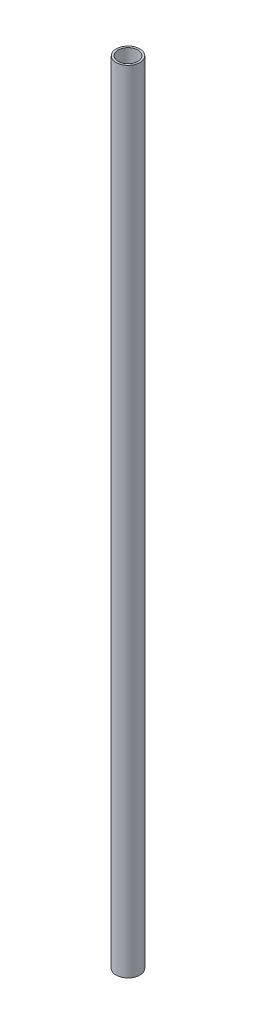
ISO-10303-21;
HEADER;
FILE_DESCRIPTION(('STEP AP214'),'2;1');
FILE_NAME('part.step','',(''),(''),'','','');
FILE_SCHEMA(('AUTOMOTIVE_DESIGN { 1 0 10303 214 1 1 1 1 }'));
ENDSEC;
DATA;
#1=APPLICATION_CONTEXT('core data for automotive mechanical design processes');
#2=APPLICATION_PROTOCOL_DEFINITION('international standard','automotive_design',2000,#1);
#3=PRODUCT_CONTEXT('',#1,'mechanical');
#4=PRODUCT('Part','Part','',(#3));
#5=PRODUCT_RELATED_PRODUCT_CATEGORY('part','',(#4));
#6=PRODUCT_DEFINITION_FORMATION('','',#4);
#7=PRODUCT_DEFINITION_CONTEXT('part definition',#1,'design');
#8=PRODUCT_DEFINITION('design','',#6,#7);
#9=PRODUCT_DEFINITION_SHAPE('','',#8);
#10=(LENGTH_UNIT() NAMED_UNIT(*) SI_UNIT(.MILLI.,.METRE.));
#11=(NAMED_UNIT(*) PLANE_ANGLE_UNIT() SI_UNIT($,.RADIAN.));
#12=(NAMED_UNIT(*) SI_UNIT($,.STERADIAN.) SOLID_ANGLE_UNIT());
#13=UNCERTAINTY_MEASURE_WITH_UNIT(LENGTH_MEASURE(1.E-05),#10,'distance_accuracy_value','');
#14=(GEOMETRIC_REPRESENTATION_CONTEXT(3) GLOBAL_UNCERTAINTY_ASSIGNED_CONTEXT((#13)) GLOBAL_UNIT_ASSIGNED_CONTEXT((#10,
#11,#12)) REPRESENTATION_CONTEXT('',''));
#15=CARTESIAN_POINT('',(0.,0.,0.));
#16=DIRECTION('',(0.,0.,1.));
#17=DIRECTION('',(1.,0.,0.));
#18=AXIS2_PLACEMENT_3D('',#15,#16,#17);
#19=CARTESIAN_POINT('',(0.,400.,0.));
#20=DIRECTION('',(0.,1.,0.));
#21=DIRECTION('',(0.,0.,1.));
#22=AXIS2_PLACEMENT_3D('',#19,#20,#21);
#23=PLANE('',#22);
#24=CARTESIAN_POINT('',(0.,400.,0.));
#25=DIRECTION('',(0.,1.,0.));
#26=DIRECTION('',(0.,0.,1.));
#27=AXIS2_PLACEMENT_3D('',#24,#25,#26);
#28=CIRCLE('',#27,6.);
#29=CARTESIAN_POINT('',(0.,400.,6.));
#30=VERTEX_POINT('',#29);
#31=EDGE_CURVE('E10',#30,#30,#28,.T.);
#32=ORIENTED_EDGE('',*,*,#31,.T.);
#33=EDGE_LOOP('',(#32));
#34=FACE_BOUND('',#33,.T.);
#35=CARTESIAN_POINT('',(0.,400.,0.));
#36=DIRECTION('',(0.,1.,0.));
#37=DIRECTION('',(0.,0.,1.));
#38=AXIS2_PLACEMENT_3D('',#35,#36,#37);
#39=CIRCLE('',#38,5.);
#40=CARTESIAN_POINT('',(0.,400.,5.));
#41=VERTEX_POINT('',#40);
#42=EDGE_CURVE('E35',#41,#41,#39,.T.);
#43=ORIENTED_EDGE('',*,*,#42,.F.);
#44=EDGE_LOOP('',(#43));
#45=FACE_BOUND('',#44,.T.);
#46=ADVANCED_FACE('F24',(#34,#45),#23,.T.);
#47=CARTESIAN_POINT('',(0.,0.,0.));
#48=DIRECTION('',(0.,1.,0.));
#49=DIRECTION('',(0.,0.,1.));
#50=AXIS2_PLACEMENT_3D('',#47,#48,#49);
#51=PLANE('',#50);
#52=CARTESIAN_POINT('',(0.,0.,0.));
#53=DIRECTION('',(0.,1.,0.));
#54=DIRECTION('',(0.,0.,1.));
#55=AXIS2_PLACEMENT_3D('',#52,#53,#54);
#56=CIRCLE('',#55,6.);
#57=CARTESIAN_POINT('',(0.,0.,6.));
#58=VERTEX_POINT('',#57);
#59=EDGE_CURVE('E31',#58,#58,#56,.T.);
#60=ORIENTED_EDGE('',*,*,#59,.F.);
#61=EDGE_LOOP('',(#60));
#62=FACE_BOUND('',#61,.T.);
#63=CARTESIAN_POINT('',(0.,0.,0.));
#64=DIRECTION('',(0.,1.,0.));
#65=DIRECTION('',(0.,0.,1.));
#66=AXIS2_PLACEMENT_3D('',#63,#64,#65);
#67=CIRCLE('',#66,5.);
#68=CARTESIAN_POINT('',(0.,0.,5.));
#69=VERTEX_POINT('',#68);
#70=EDGE_CURVE('E39',#69,#69,#67,.T.);
#71=ORIENTED_EDGE('',*,*,#70,.T.);
#72=EDGE_LOOP('',(#71));
#73=FACE_BOUND('',#72,.T.);
#74=ADVANCED_FACE('F45',(#62,#73),#51,.F.);
#75=CARTESIAN_POINT('',(0.,400.,0.));
#76=DIRECTION('',(0.,-1.,0.));
#77=DIRECTION('',(0.,0.,-1.));
#78=AXIS2_PLACEMENT_3D('',#75,#76,#77);
#79=CYLINDRICAL_SURFACE('',#78,6.);
#80=ORIENTED_EDGE('',*,*,#31,.F.);
#81=EDGE_LOOP('',(#80));
#82=FACE_BOUND('',#81,.T.);
#83=ORIENTED_EDGE('',*,*,#59,.T.);
#84=EDGE_LOOP('',(#83));
#85=FACE_BOUND('',#84,.T.);
#86=ADVANCED_FACE('F26',(#82,#85),#79,.T.);
#87=CARTESIAN_POINT('',(0.,400.,0.));
#88=DIRECTION('',(0.,-1.,0.));
#89=DIRECTION('',(0.,0.,-1.));
#90=AXIS2_PLACEMENT_3D('',#87,#88,#89);
#91=CYLINDRICAL_SURFACE('',#90,5.);
#92=ORIENTED_EDGE('',*,*,#42,.T.);
#93=EDGE_LOOP('',(#92));
#94=FACE_BOUND('',#93,.T.);
#95=ORIENTED_EDGE('',*,*,#70,.F.);
#96=EDGE_LOOP('',(#95));
#97=FACE_BOUND('',#96,.T.);
#98=ADVANCED_FACE('F47',(#94,#97),#91,.F.);
#99=CLOSED_SHELL('',(#46,#74,#86,#98));
#100=MANIFOLD_SOLID_BREP('B2',#99);
#101=ADVANCED_BREP_SHAPE_REPRESENTATION('',(#18,#100),#14);
#102=SHAPE_DEFINITION_REPRESENTATION(#9,#101);
ENDSEC;
END-ISO-10303-21;
